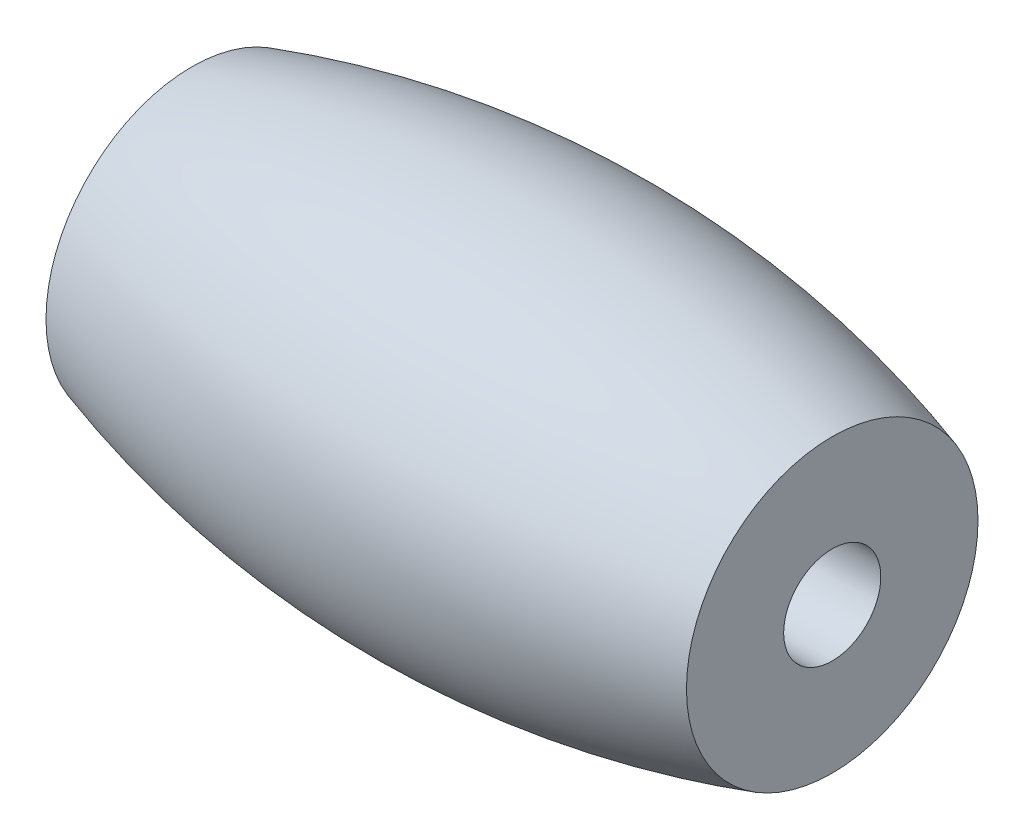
ISO-10303-21;
HEADER;
FILE_DESCRIPTION(('STEP AP214'),'2;1');
FILE_NAME('part.step','',(''),(''),'','','');
FILE_SCHEMA(('AUTOMOTIVE_DESIGN { 1 0 10303 214 1 1 1 1 }'));
ENDSEC;
DATA;
#1=APPLICATION_CONTEXT('core data for automotive mechanical design processes');
#2=APPLICATION_PROTOCOL_DEFINITION('international standard','automotive_design',2000,#1);
#3=PRODUCT_CONTEXT('',#1,'mechanical');
#4=PRODUCT('Part','Part','',(#3));
#5=PRODUCT_RELATED_PRODUCT_CATEGORY('part','',(#4));
#6=PRODUCT_DEFINITION_FORMATION('','',#4);
#7=PRODUCT_DEFINITION_CONTEXT('part definition',#1,'design');
#8=PRODUCT_DEFINITION('design','',#6,#7);
#9=PRODUCT_DEFINITION_SHAPE('','',#8);
#10=(LENGTH_UNIT() NAMED_UNIT(*) SI_UNIT(.MILLI.,.METRE.));
#11=(NAMED_UNIT(*) PLANE_ANGLE_UNIT() SI_UNIT($,.RADIAN.));
#12=(NAMED_UNIT(*) SI_UNIT($,.STERADIAN.) SOLID_ANGLE_UNIT());
#13=UNCERTAINTY_MEASURE_WITH_UNIT(LENGTH_MEASURE(1.E-05),#10,'distance_accuracy_value','');
#14=(GEOMETRIC_REPRESENTATION_CONTEXT(3) GLOBAL_UNCERTAINTY_ASSIGNED_CONTEXT((#13)) GLOBAL_UNIT_ASSIGNED_CONTEXT((#10,
#11,#12)) REPRESENTATION_CONTEXT('',''));
#15=CARTESIAN_POINT('',(0.,0.,0.));
#16=DIRECTION('',(0.,0.,1.));
#17=DIRECTION('',(1.,0.,0.));
#18=AXIS2_PLACEMENT_3D('',#15,#16,#17);
#19=CARTESIAN_POINT('',(7.25,0.,0.));
#20=DIRECTION('',(1.,0.,0.));
#21=DIRECTION('',(0.,0.,-1.));
#22=AXIS2_PLACEMENT_3D('',#19,#20,#21);
#23=PLANE('',#22);
#24=CARTESIAN_POINT('',(7.25,0.,0.));
#25=DIRECTION('',(-1.,0.,0.));
#26=DIRECTION('',(0.,0.,1.));
#27=AXIS2_PLACEMENT_3D('',#24,#25,#26);
#28=CIRCLE('',#27,1.1);
#29=CARTESIAN_POINT('',(7.25,0.,1.1));
#30=VERTEX_POINT('',#29);
#31=EDGE_CURVE('E41',#30,#30,#28,.T.);
#32=ORIENTED_EDGE('',*,*,#31,.T.);
#33=EDGE_LOOP('',(#32));
#34=FACE_BOUND('',#33,.T.);
#35=CARTESIAN_POINT('',(7.25,0.,0.));
#36=DIRECTION('',(-1.,0.,0.));
#37=DIRECTION('',(0.,0.,1.));
#38=AXIS2_PLACEMENT_3D('',#35,#36,#37);
#39=CIRCLE('',#38,3.3);
#40=CARTESIAN_POINT('',(7.25,0.,3.3));
#41=VERTEX_POINT('',#40);
#42=EDGE_CURVE('E10',#41,#41,#39,.T.);
#43=ORIENTED_EDGE('',*,*,#42,.F.);
#44=EDGE_LOOP('',(#43));
#45=FACE_BOUND('',#44,.T.);
#46=ADVANCED_FACE('F31',(#34,#45),#23,.T.);
#47=CARTESIAN_POINT('',(0.,0.,0.));
#48=DIRECTION('',(-1.,0.,0.));
#49=DIRECTION('',(0.,0.,1.));
#50=AXIS2_PLACEMENT_3D('',#47,#48,#49);
#51=DEGENERATE_TOROIDAL_SURFACE('',#50,20.0420454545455,24.4420454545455,.F.);
#52=ORIENTED_EDGE('',*,*,#42,.T.);
#53=EDGE_LOOP('',(#52));
#54=FACE_BOUND('',#53,.T.);
#55=CARTESIAN_POINT('',(-7.25,0.,0.));
#56=DIRECTION('',(-1.,0.,0.));
#57=DIRECTION('',(0.,0.,1.));
#58=AXIS2_PLACEMENT_3D('',#55,#56,#57);
#59=CIRCLE('',#58,3.3);
#60=CARTESIAN_POINT('',(-7.25,0.,3.3));
#61=VERTEX_POINT('',#60);
#62=EDGE_CURVE('E37',#61,#61,#59,.T.);
#63=ORIENTED_EDGE('',*,*,#62,.F.);
#64=EDGE_LOOP('',(#63));
#65=FACE_BOUND('',#64,.T.);
#66=ADVANCED_FACE('F55',(#54,#65),#51,.F.);
#67=CARTESIAN_POINT('',(-7.25,0.,0.));
#68=DIRECTION('',(-1.,0.,0.));
#69=DIRECTION('',(0.,0.,1.));
#70=AXIS2_PLACEMENT_3D('',#67,#68,#69);
#71=PLANE('',#70);
#72=CARTESIAN_POINT('',(-7.25,0.,0.));
#73=DIRECTION('',(-1.,0.,0.));
#74=DIRECTION('',(0.,0.,1.));
#75=AXIS2_PLACEMENT_3D('',#72,#73,#74);
#76=CIRCLE('',#75,1.1);
#77=CARTESIAN_POINT('',(-7.25,0.,1.1));
#78=VERTEX_POINT('',#77);
#79=EDGE_CURVE('E45',#78,#78,#76,.T.);
#80=ORIENTED_EDGE('',*,*,#79,.F.);
#81=EDGE_LOOP('',(#80));
#82=FACE_BOUND('',#81,.T.);
#83=ORIENTED_EDGE('',*,*,#62,.T.);
#84=EDGE_LOOP('',(#83));
#85=FACE_BOUND('',#84,.T.);
#86=ADVANCED_FACE('F53',(#82,#85),#71,.T.);
#87=CARTESIAN_POINT('',(7.25,0.,0.));
#88=DIRECTION('',(-1.,0.,0.));
#89=DIRECTION('',(0.,0.,1.));
#90=AXIS2_PLACEMENT_3D('',#87,#88,#89);
#91=CYLINDRICAL_SURFACE('',#90,1.1);
#92=ORIENTED_EDGE('',*,*,#31,.F.);
#93=EDGE_LOOP('',(#92));
#94=FACE_BOUND('',#93,.T.);
#95=ORIENTED_EDGE('',*,*,#79,.T.);
#96=EDGE_LOOP('',(#95));
#97=FACE_BOUND('',#96,.T.);
#98=ADVANCED_FACE('F51',(#94,#97),#91,.F.);
#99=CLOSED_SHELL('',(#46,#66,#86,#98));
#100=MANIFOLD_SOLID_BREP('B2',#99);
#101=ADVANCED_BREP_SHAPE_REPRESENTATION('',(#18,#100),#14);
#102=SHAPE_DEFINITION_REPRESENTATION(#9,#101);
ENDSEC;
END-ISO-10303-21;
